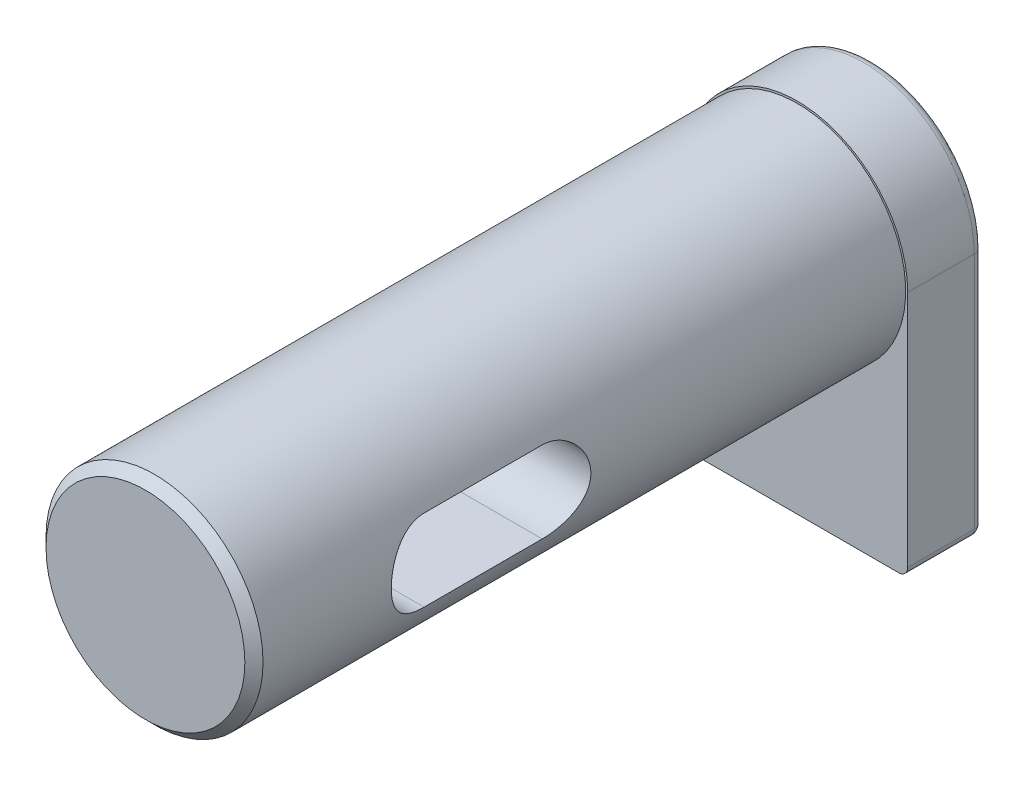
from build123d import *

# Parameters (mm, degrees)
EXTRUDE_1_DEPTH     = 3.302
SKETCH_2_R          = 4.7371
EXTRUDE_2_DEPTH     = 28.448
CUT_EXTRUDE_1_DEPTH = 14.224
FILLET_1_R          = 0.396875
CHAMFER_1_SIZE      = 0.396875


with BuildPart() as part:
    # Sketch 1 → Extrude 1 (new body)
    with BuildSketch(Plane.XY):
        with BuildLine():
            Line((4.826, 0), (4.826, -10.398125))
            ThreePointArc((4.826, -10.398125), (4.709758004, -10.678758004), (4.429125, -10.795))
            Line((4.429125, -10.795), (-4.429125, -10.795))
            ThreePointArc((-4.429125, -10.795), (-4.709758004, -10.678758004), (-4.826, -10.398125))
            Line((-4.826, -10.398125), (-4.826, 0))
            ThreePointArc((-4.826, 0), (0, 4.826), (4.826, 0))
        make_face()
    extrude(amount=EXTRUDE_1_DEPTH)

    # Sketch 2 → Extrude 2 (add)
    with BuildSketch(Plane.XY.offset(3.302)):
        with Locations(Location((0, 0, 0), (0, 0, 180))):
            Circle(SKETCH_2_R)
    extrude(amount=EXTRUDE_2_DEPTH)

    # Sketch 3 → Cut-Extrude 1 (cut, symmetric)
    with BuildSketch(Plane(origin=(0, 0, 0), x_dir=(0, 0, -1), z_dir=(1, 0, 0))):
        with BuildLine():
            Line((-23.9776, 1.778), (-18.8214, 1.778))
            ThreePointArc((-18.8214, 1.778), (-17.0434, 0), (-18.8214, -1.778))
            Line((-18.8214, -1.778), (-23.9776, -1.778))
            ThreePointArc((-23.9776, -1.778), (-25.7556, 0), (-23.9776, 1.778))
        make_face()
    extrude(amount=CUT_EXTRUDE_1_DEPTH, both=True, mode=Mode.SUBTRACT)

    # Fillet 1
    fillet_1_edges = [part.edges().sort_by_distance(p)[0] for p in [
        (4.826, -5.1990625, 0),
        (4.709758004, -10.678758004, 0),
        (0, -10.795, 0),
        (-4.709758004, -10.678758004, 0),
        (-4.826, -5.1990625, 0),
        (0, 4.826, 0),
    ]]
    fillet(fillet_1_edges, radius=FILLET_1_R)

    # Chamfer 1
    chamfer_1_edges = [part.edges().sort_by_distance(p)[0] for p in [
        (4.7371, 0, 31.75),
    ]]
    chamfer(chamfer_1_edges, length=CHAMFER_1_SIZE)


solid = part.part
